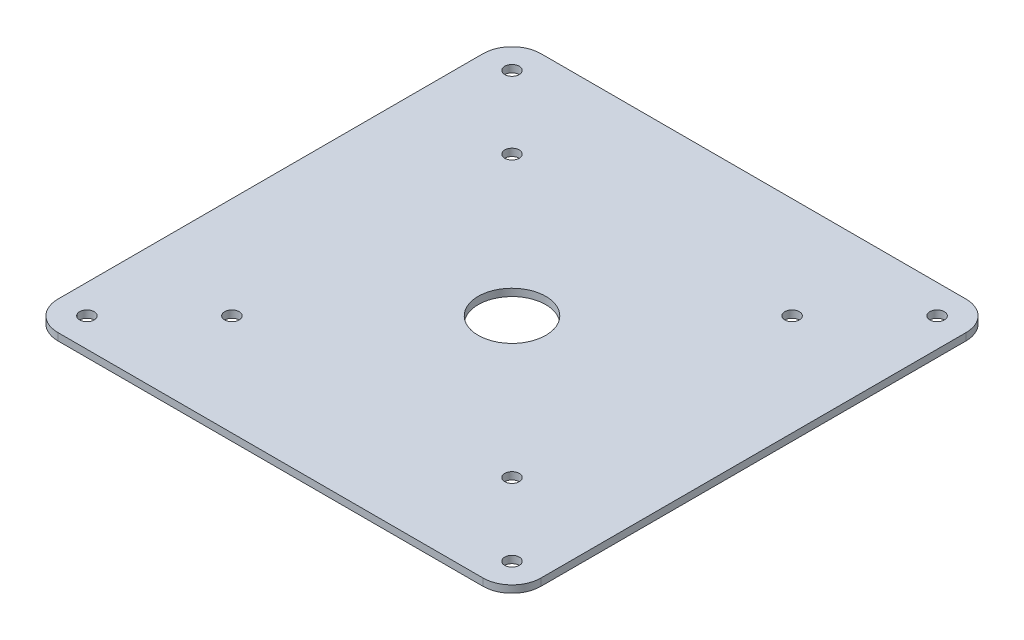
ISO-10303-21;
HEADER;
FILE_DESCRIPTION(('STEP AP214'),'2;1');
FILE_NAME('part.step','',(''),(''),'','','');
FILE_SCHEMA(('AUTOMOTIVE_DESIGN { 1 0 10303 214 1 1 1 1 }'));
ENDSEC;
DATA;
#1=APPLICATION_CONTEXT('core data for automotive mechanical design processes');
#2=APPLICATION_PROTOCOL_DEFINITION('international standard','automotive_design',2000,#1);
#3=PRODUCT_CONTEXT('',#1,'mechanical');
#4=PRODUCT('Part','Part','',(#3));
#5=PRODUCT_RELATED_PRODUCT_CATEGORY('part','',(#4));
#6=PRODUCT_DEFINITION_FORMATION('','',#4);
#7=PRODUCT_DEFINITION_CONTEXT('part definition',#1,'design');
#8=PRODUCT_DEFINITION('design','',#6,#7);
#9=PRODUCT_DEFINITION_SHAPE('','',#8);
#10=(LENGTH_UNIT() NAMED_UNIT(*) SI_UNIT(.MILLI.,.METRE.));
#11=(NAMED_UNIT(*) PLANE_ANGLE_UNIT() SI_UNIT($,.RADIAN.));
#12=(NAMED_UNIT(*) SI_UNIT($,.STERADIAN.) SOLID_ANGLE_UNIT());
#13=UNCERTAINTY_MEASURE_WITH_UNIT(LENGTH_MEASURE(1.E-05),#10,'distance_accuracy_value','');
#14=(GEOMETRIC_REPRESENTATION_CONTEXT(3) GLOBAL_UNCERTAINTY_ASSIGNED_CONTEXT((#13)) GLOBAL_UNIT_ASSIGNED_CONTEXT((#10,
#11,#12)) REPRESENTATION_CONTEXT('',''));
#15=CARTESIAN_POINT('',(0.,0.,0.));
#16=DIRECTION('',(0.,0.,1.));
#17=DIRECTION('',(1.,0.,0.));
#18=AXIS2_PLACEMENT_3D('',#15,#16,#17);
#19=CARTESIAN_POINT('',(-50.,-1.5,50.));
#20=DIRECTION('',(-1.,0.,0.));
#21=DIRECTION('',(0.,0.,1.));
#22=AXIS2_PLACEMENT_3D('',#19,#20,#21);
#23=PLANE('',#22);
#24=DIRECTION('',(0.,0.,1.));
#25=VECTOR('',#24,1.);
#26=CARTESIAN_POINT('',(-50.,0.,50.));
#27=LINE('',#26,#25);
#28=CARTESIAN_POINT('',(-50.,0.,-44.));
#29=VERTEX_POINT('',#28);
#30=CARTESIAN_POINT('',(-50.,0.,44.));
#31=VERTEX_POINT('',#30);
#32=EDGE_CURVE('E168',#29,#31,#27,.T.);
#33=ORIENTED_EDGE('',*,*,#32,.F.);
#34=DIRECTION('',(0.,1.,0.));
#35=VECTOR('',#34,1.);
#36=CARTESIAN_POINT('',(-50.,-1.5,-44.));
#37=LINE('',#36,#35);
#38=CARTESIAN_POINT('',(-50.,-1.5,-44.));
#39=VERTEX_POINT('',#38);
#40=EDGE_CURVE('E148',#29,#39,#37,.F.);
#41=ORIENTED_EDGE('',*,*,#40,.T.);
#42=DIRECTION('',(0.,0.,1.));
#43=VECTOR('',#42,1.);
#44=CARTESIAN_POINT('',(-50.,-1.5,50.));
#45=LINE('',#44,#43);
#46=CARTESIAN_POINT('',(-50.,-1.5,44.));
#47=VERTEX_POINT('',#46);
#48=EDGE_CURVE('E129',#39,#47,#45,.T.);
#49=ORIENTED_EDGE('',*,*,#48,.T.);
#50=DIRECTION('',(0.,1.,0.));
#51=VECTOR('',#50,1.);
#52=CARTESIAN_POINT('',(-50.,-1.5,44.));
#53=LINE('',#52,#51);
#54=EDGE_CURVE('E145',#47,#31,#53,.T.);
#55=ORIENTED_EDGE('',*,*,#54,.T.);
#56=EDGE_LOOP('',(#33,#41,#49,#55));
#57=FACE_BOUND('',#56,.T.);
#58=ADVANCED_FACE('F42',(#57),#23,.T.);
#59=CARTESIAN_POINT('',(50.,-1.5,-50.));
#60=DIRECTION('',(0.,0.,-1.));
#61=DIRECTION('',(-1.,0.,0.));
#62=AXIS2_PLACEMENT_3D('',#59,#60,#61);
#63=PLANE('',#62);
#64=DIRECTION('',(-1.,0.,0.));
#65=VECTOR('',#64,1.);
#66=CARTESIAN_POINT('',(50.,-1.5,-50.));
#67=LINE('',#66,#65);
#68=CARTESIAN_POINT('',(44.,-1.5,-50.));
#69=VERTEX_POINT('',#68);
#70=CARTESIAN_POINT('',(-44.,-1.5,-50.));
#71=VERTEX_POINT('',#70);
#72=EDGE_CURVE('E134',#69,#71,#67,.T.);
#73=ORIENTED_EDGE('',*,*,#72,.T.);
#74=DIRECTION('',(0.,1.,0.));
#75=VECTOR('',#74,1.);
#76=CARTESIAN_POINT('',(-44.,-1.5,-50.));
#77=LINE('',#76,#75);
#78=CARTESIAN_POINT('',(-44.,0.,-50.));
#79=VERTEX_POINT('',#78);
#80=EDGE_CURVE('E128',#71,#79,#77,.T.);
#81=ORIENTED_EDGE('',*,*,#80,.T.);
#82=DIRECTION('',(-1.,0.,0.));
#83=VECTOR('',#82,1.);
#84=CARTESIAN_POINT('',(50.,0.,-50.));
#85=LINE('',#84,#83);
#86=CARTESIAN_POINT('',(44.,0.,-50.));
#87=VERTEX_POINT('',#86);
#88=EDGE_CURVE('E111',#87,#79,#85,.T.);
#89=ORIENTED_EDGE('',*,*,#88,.F.);
#90=DIRECTION('',(0.,1.,0.));
#91=VECTOR('',#90,1.);
#92=CARTESIAN_POINT('',(44.,-1.5,-50.));
#93=LINE('',#92,#91);
#94=EDGE_CURVE('E125',#87,#69,#93,.F.);
#95=ORIENTED_EDGE('',*,*,#94,.T.);
#96=EDGE_LOOP('',(#73,#81,#89,#95));
#97=FACE_BOUND('',#96,.T.);
#98=ADVANCED_FACE('F124',(#97),#63,.T.);
#99=CARTESIAN_POINT('',(50.,-1.5,50.));
#100=DIRECTION('',(1.,0.,0.));
#101=DIRECTION('',(0.,0.,-1.));
#102=AXIS2_PLACEMENT_3D('',#99,#100,#101);
#103=PLANE('',#102);
#104=DIRECTION('',(0.,0.,-1.));
#105=VECTOR('',#104,1.);
#106=CARTESIAN_POINT('',(50.,-1.5,50.));
#107=LINE('',#106,#105);
#108=CARTESIAN_POINT('',(50.,-1.5,44.));
#109=VERTEX_POINT('',#108);
#110=CARTESIAN_POINT('',(50.,-1.5,-44.));
#111=VERTEX_POINT('',#110);
#112=EDGE_CURVE('E138',#109,#111,#107,.T.);
#113=ORIENTED_EDGE('',*,*,#112,.T.);
#114=DIRECTION('',(0.,1.,0.));
#115=VECTOR('',#114,1.);
#116=CARTESIAN_POINT('',(50.,-1.5,-44.));
#117=LINE('',#116,#115);
#118=CARTESIAN_POINT('',(50.,0.,-44.));
#119=VERTEX_POINT('',#118);
#120=EDGE_CURVE('E158',#111,#119,#117,.T.);
#121=ORIENTED_EDGE('',*,*,#120,.T.);
#122=DIRECTION('',(0.,0.,-1.));
#123=VECTOR('',#122,1.);
#124=CARTESIAN_POINT('',(50.,0.,50.));
#125=LINE('',#124,#123);
#126=CARTESIAN_POINT('',(50.,0.,44.));
#127=VERTEX_POINT('',#126);
#128=EDGE_CURVE('E113',#127,#119,#125,.T.);
#129=ORIENTED_EDGE('',*,*,#128,.F.);
#130=DIRECTION('',(0.,1.,0.));
#131=VECTOR('',#130,1.);
#132=CARTESIAN_POINT('',(50.,-1.5,44.));
#133=LINE('',#132,#131);
#134=EDGE_CURVE('E156',#127,#109,#133,.F.);
#135=ORIENTED_EDGE('',*,*,#134,.T.);
#136=EDGE_LOOP('',(#113,#121,#129,#135));
#137=FACE_BOUND('',#136,.T.);
#138=ADVANCED_FACE('F161',(#137),#103,.T.);
#139=CARTESIAN_POINT('',(50.,-1.5,50.));
#140=DIRECTION('',(0.,0.,1.));
#141=DIRECTION('',(1.,0.,0.));
#142=AXIS2_PLACEMENT_3D('',#139,#140,#141);
#143=PLANE('',#142);
#144=DIRECTION('',(1.,0.,0.));
#145=VECTOR('',#144,1.);
#146=CARTESIAN_POINT('',(50.,-1.5,50.));
#147=LINE('',#146,#145);
#148=CARTESIAN_POINT('',(-44.,-1.5,50.));
#149=VERTEX_POINT('',#148);
#150=CARTESIAN_POINT('',(44.,-1.5,50.));
#151=VERTEX_POINT('',#150);
#152=EDGE_CURVE('E163',#149,#151,#147,.T.);
#153=ORIENTED_EDGE('',*,*,#152,.T.);
#154=DIRECTION('',(0.,1.,0.));
#155=VECTOR('',#154,1.);
#156=CARTESIAN_POINT('',(44.,-1.5,50.));
#157=LINE('',#156,#155);
#158=CARTESIAN_POINT('',(44.,0.,50.));
#159=VERTEX_POINT('',#158);
#160=EDGE_CURVE('E11',#151,#159,#157,.T.);
#161=ORIENTED_EDGE('',*,*,#160,.T.);
#162=DIRECTION('',(1.,0.,0.));
#163=VECTOR('',#162,1.);
#164=CARTESIAN_POINT('',(50.,0.,50.));
#165=LINE('',#164,#163);
#166=CARTESIAN_POINT('',(-44.,0.,50.));
#167=VERTEX_POINT('',#166);
#168=EDGE_CURVE('E171',#167,#159,#165,.T.);
#169=ORIENTED_EDGE('',*,*,#168,.F.);
#170=DIRECTION('',(0.,1.,0.));
#171=VECTOR('',#170,1.);
#172=CARTESIAN_POINT('',(-44.,-1.5,50.));
#173=LINE('',#172,#171);
#174=EDGE_CURVE('E50',#167,#149,#173,.F.);
#175=ORIENTED_EDGE('',*,*,#174,.T.);
#176=EDGE_LOOP('',(#153,#161,#169,#175));
#177=FACE_BOUND('',#176,.T.);
#178=ADVANCED_FACE('F174',(#177),#143,.T.);
#179=CARTESIAN_POINT('',(0.,-1.5,0.));
#180=DIRECTION('',(0.,1.,0.));
#181=DIRECTION('',(0.,0.,1.));
#182=AXIS2_PLACEMENT_3D('',#179,#180,#181);
#183=PLANE('',#182);
#184=CARTESIAN_POINT('',(0.,-1.5,0.));
#185=DIRECTION('',(0.,1.,0.));
#186=DIRECTION('',(0.,0.,1.));
#187=AXIS2_PLACEMENT_3D('',#184,#185,#186);
#188=CIRCLE('',#187,7.);
#189=CARTESIAN_POINT('',(0.,-1.5,7.));
#190=VERTEX_POINT('',#189);
#191=EDGE_CURVE('E221',#190,#190,#188,.T.);
#192=ORIENTED_EDGE('',*,*,#191,.T.);
#193=EDGE_LOOP('',(#192));
#194=FACE_BOUND('',#193,.T.);
#195=CARTESIAN_POINT('',(-44.,-1.5,44.));
#196=DIRECTION('',(0.,1.,0.));
#197=DIRECTION('',(0.,0.,-1.));
#198=AXIS2_PLACEMENT_3D('',#195,#196,#197);
#199=CIRCLE('',#198,1.5);
#200=CARTESIAN_POINT('',(-44.,-1.5,42.5));
#201=VERTEX_POINT('',#200);
#202=EDGE_CURVE('E217',#201,#201,#199,.T.);
#203=ORIENTED_EDGE('',*,*,#202,.T.);
#204=EDGE_LOOP('',(#203));
#205=FACE_BOUND('',#204,.T.);
#206=CARTESIAN_POINT('',(44.,-1.5,44.));
#207=DIRECTION('',(0.,1.,0.));
#208=DIRECTION('',(0.,0.,-1.));
#209=AXIS2_PLACEMENT_3D('',#206,#207,#208);
#210=CIRCLE('',#209,1.5);
#211=CARTESIAN_POINT('',(44.,-1.5,42.5));
#212=VERTEX_POINT('',#211);
#213=EDGE_CURVE('E224',#212,#212,#210,.T.);
#214=ORIENTED_EDGE('',*,*,#213,.T.);
#215=EDGE_LOOP('',(#214));
#216=FACE_BOUND('',#215,.T.);
#217=CARTESIAN_POINT('',(44.,-1.5,-44.));
#218=DIRECTION('',(0.,1.,0.));
#219=DIRECTION('',(0.,0.,1.));
#220=AXIS2_PLACEMENT_3D('',#217,#218,#219);
#221=CIRCLE('',#220,1.5);
#222=CARTESIAN_POINT('',(44.,-1.5,-42.5));
#223=VERTEX_POINT('',#222);
#224=EDGE_CURVE('E230',#223,#223,#221,.T.);
#225=ORIENTED_EDGE('',*,*,#224,.T.);
#226=EDGE_LOOP('',(#225));
#227=FACE_BOUND('',#226,.T.);
#228=CARTESIAN_POINT('',(-44.,-1.5,-44.));
#229=DIRECTION('',(0.,1.,0.));
#230=DIRECTION('',(0.,0.,1.));
#231=AXIS2_PLACEMENT_3D('',#228,#229,#230);
#232=CIRCLE('',#231,1.5);
#233=CARTESIAN_POINT('',(-44.,-1.5,-42.5));
#234=VERTEX_POINT('',#233);
#235=EDGE_CURVE('E208',#234,#234,#232,.T.);
#236=ORIENTED_EDGE('',*,*,#235,.T.);
#237=EDGE_LOOP('',(#236));
#238=FACE_BOUND('',#237,.T.);
#239=CARTESIAN_POINT('',(-28.9913780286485,-1.5,28.9913780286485));
#240=DIRECTION('',(0.,1.,0.));
#241=DIRECTION('',(0.,0.,1.));
#242=AXIS2_PLACEMENT_3D('',#239,#240,#241);
#243=CIRCLE('',#242,1.5);
#244=CARTESIAN_POINT('',(-28.9913780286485,-1.5,30.4913780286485));
#245=VERTEX_POINT('',#244);
#246=EDGE_CURVE('E202',#245,#245,#243,.T.);
#247=ORIENTED_EDGE('',*,*,#246,.T.);
#248=EDGE_LOOP('',(#247));
#249=FACE_BOUND('',#248,.T.);
#250=CARTESIAN_POINT('',(-28.9913780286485,-1.5,-28.9913780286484));
#251=DIRECTION('',(0.,1.,0.));
#252=DIRECTION('',(0.,0.,1.));
#253=AXIS2_PLACEMENT_3D('',#250,#251,#252);
#254=CIRCLE('',#253,1.5);
#255=CARTESIAN_POINT('',(-28.9913780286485,-1.5,-27.4913780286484));
#256=VERTEX_POINT('',#255);
#257=EDGE_CURVE('E196',#256,#256,#254,.T.);
#258=ORIENTED_EDGE('',*,*,#257,.T.);
#259=EDGE_LOOP('',(#258));
#260=FACE_BOUND('',#259,.T.);
#261=CARTESIAN_POINT('',(28.9913780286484,-1.5,28.9913780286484));
#262=DIRECTION('',(0.,1.,0.));
#263=DIRECTION('',(0.,0.,1.));
#264=AXIS2_PLACEMENT_3D('',#261,#262,#263);
#265=CIRCLE('',#264,1.5);
#266=CARTESIAN_POINT('',(28.9913780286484,-1.5,30.4913780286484));
#267=VERTEX_POINT('',#266);
#268=EDGE_CURVE('E190',#267,#267,#265,.T.);
#269=ORIENTED_EDGE('',*,*,#268,.T.);
#270=EDGE_LOOP('',(#269));
#271=FACE_BOUND('',#270,.T.);
#272=CARTESIAN_POINT('',(28.9913780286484,-1.5,-28.9913780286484));
#273=DIRECTION('',(0.,1.,0.));
#274=DIRECTION('',(0.,0.,1.));
#275=AXIS2_PLACEMENT_3D('',#272,#273,#274);
#276=CIRCLE('',#275,1.5);
#277=CARTESIAN_POINT('',(28.9913780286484,-1.5,-27.4913780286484));
#278=VERTEX_POINT('',#277);
#279=EDGE_CURVE('E172',#278,#278,#276,.T.);
#280=ORIENTED_EDGE('',*,*,#279,.T.);
#281=EDGE_LOOP('',(#280));
#282=FACE_BOUND('',#281,.T.);
#283=ORIENTED_EDGE('',*,*,#48,.F.);
#284=CARTESIAN_POINT('',(-44.,-1.5,-44.));
#285=DIRECTION('',(0.,1.,0.));
#286=DIRECTION('',(0.,0.,1.));
#287=AXIS2_PLACEMENT_3D('',#284,#285,#286);
#288=CIRCLE('',#287,6.);
#289=EDGE_CURVE('E154',#39,#71,#288,.F.);
#290=ORIENTED_EDGE('',*,*,#289,.T.);
#291=ORIENTED_EDGE('',*,*,#72,.F.);
#292=CARTESIAN_POINT('',(44.,-1.5,-44.));
#293=DIRECTION('',(0.,1.,0.));
#294=DIRECTION('',(0.,0.,1.));
#295=AXIS2_PLACEMENT_3D('',#292,#293,#294);
#296=CIRCLE('',#295,6.);
#297=EDGE_CURVE('E133',#69,#111,#296,.F.);
#298=ORIENTED_EDGE('',*,*,#297,.T.);
#299=ORIENTED_EDGE('',*,*,#112,.F.);
#300=CARTESIAN_POINT('',(44.,-1.5,44.));
#301=DIRECTION('',(0.,1.,0.));
#302=DIRECTION('',(0.,0.,1.));
#303=AXIS2_PLACEMENT_3D('',#300,#301,#302);
#304=CIRCLE('',#303,6.);
#305=EDGE_CURVE('E57',#109,#151,#304,.F.);
#306=ORIENTED_EDGE('',*,*,#305,.T.);
#307=ORIENTED_EDGE('',*,*,#152,.F.);
#308=CARTESIAN_POINT('',(-44.,-1.5,44.));
#309=DIRECTION('',(0.,1.,0.));
#310=DIRECTION('',(0.,0.,1.));
#311=AXIS2_PLACEMENT_3D('',#308,#309,#310);
#312=CIRCLE('',#311,6.);
#313=EDGE_CURVE('E150',#149,#47,#312,.F.);
#314=ORIENTED_EDGE('',*,*,#313,.T.);
#315=EDGE_LOOP('',(#283,#290,#291,#298,#299,#306,#307,#314));
#316=FACE_BOUND('',#315,.T.);
#317=ADVANCED_FACE('F181',(#194,#205,#216,#227,#238,#249,#260,#271,#282,#316),#183,.F.);
#318=CARTESIAN_POINT('',(0.,0.,0.));
#319=DIRECTION('',(0.,1.,0.));
#320=DIRECTION('',(0.,0.,1.));
#321=AXIS2_PLACEMENT_3D('',#318,#319,#320);
#322=PLANE('',#321);
#323=CARTESIAN_POINT('',(0.,0.,0.));
#324=DIRECTION('',(0.,1.,0.));
#325=DIRECTION('',(0.,0.,1.));
#326=AXIS2_PLACEMENT_3D('',#323,#324,#325);
#327=CIRCLE('',#326,7.);
#328=CARTESIAN_POINT('',(0.,0.,7.));
#329=VERTEX_POINT('',#328);
#330=EDGE_CURVE('E235',#329,#329,#327,.T.);
#331=ORIENTED_EDGE('',*,*,#330,.F.);
#332=EDGE_LOOP('',(#331));
#333=FACE_BOUND('',#332,.T.);
#334=CARTESIAN_POINT('',(-44.,0.,44.));
#335=DIRECTION('',(0.,1.,0.));
#336=DIRECTION('',(0.,0.,-1.));
#337=AXIS2_PLACEMENT_3D('',#334,#335,#336);
#338=CIRCLE('',#337,1.5);
#339=CARTESIAN_POINT('',(-44.,0.,42.5));
#340=VERTEX_POINT('',#339);
#341=EDGE_CURVE('E220',#340,#340,#338,.T.);
#342=ORIENTED_EDGE('',*,*,#341,.F.);
#343=EDGE_LOOP('',(#342));
#344=FACE_BOUND('',#343,.T.);
#345=CARTESIAN_POINT('',(44.,0.,44.));
#346=DIRECTION('',(0.,1.,0.));
#347=DIRECTION('',(0.,0.,-1.));
#348=AXIS2_PLACEMENT_3D('',#345,#346,#347);
#349=CIRCLE('',#348,1.5);
#350=CARTESIAN_POINT('',(44.,0.,42.5));
#351=VERTEX_POINT('',#350);
#352=EDGE_CURVE('E227',#351,#351,#349,.T.);
#353=ORIENTED_EDGE('',*,*,#352,.F.);
#354=EDGE_LOOP('',(#353));
#355=FACE_BOUND('',#354,.T.);
#356=CARTESIAN_POINT('',(44.,0.,-44.));
#357=DIRECTION('',(0.,1.,0.));
#358=DIRECTION('',(0.,0.,1.));
#359=AXIS2_PLACEMENT_3D('',#356,#357,#358);
#360=CIRCLE('',#359,1.5);
#361=CARTESIAN_POINT('',(44.,0.,-42.5));
#362=VERTEX_POINT('',#361);
#363=EDGE_CURVE('E214',#362,#362,#360,.T.);
#364=ORIENTED_EDGE('',*,*,#363,.F.);
#365=EDGE_LOOP('',(#364));
#366=FACE_BOUND('',#365,.T.);
#367=CARTESIAN_POINT('',(-44.,0.,-44.));
#368=DIRECTION('',(0.,1.,0.));
#369=DIRECTION('',(0.,0.,1.));
#370=AXIS2_PLACEMENT_3D('',#367,#368,#369);
#371=CIRCLE('',#370,1.5);
#372=CARTESIAN_POINT('',(-44.,0.,-42.5));
#373=VERTEX_POINT('',#372);
#374=EDGE_CURVE('E211',#373,#373,#371,.T.);
#375=ORIENTED_EDGE('',*,*,#374,.F.);
#376=EDGE_LOOP('',(#375));
#377=FACE_BOUND('',#376,.T.);
#378=CARTESIAN_POINT('',(-28.9913780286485,0.,28.9913780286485));
#379=DIRECTION('',(0.,1.,0.));
#380=DIRECTION('',(0.,0.,1.));
#381=AXIS2_PLACEMENT_3D('',#378,#379,#380);
#382=CIRCLE('',#381,1.5);
#383=CARTESIAN_POINT('',(-28.9913780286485,0.,30.4913780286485));
#384=VERTEX_POINT('',#383);
#385=EDGE_CURVE('E205',#384,#384,#382,.T.);
#386=ORIENTED_EDGE('',*,*,#385,.F.);
#387=EDGE_LOOP('',(#386));
#388=FACE_BOUND('',#387,.T.);
#389=CARTESIAN_POINT('',(-28.9913780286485,0.,-28.9913780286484));
#390=DIRECTION('',(0.,1.,0.));
#391=DIRECTION('',(0.,0.,1.));
#392=AXIS2_PLACEMENT_3D('',#389,#390,#391);
#393=CIRCLE('',#392,1.5);
#394=CARTESIAN_POINT('',(-28.9913780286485,0.,-27.4913780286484));
#395=VERTEX_POINT('',#394);
#396=EDGE_CURVE('E199',#395,#395,#393,.T.);
#397=ORIENTED_EDGE('',*,*,#396,.F.);
#398=EDGE_LOOP('',(#397));
#399=FACE_BOUND('',#398,.T.);
#400=CARTESIAN_POINT('',(28.9913780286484,0.,28.9913780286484));
#401=DIRECTION('',(0.,1.,0.));
#402=DIRECTION('',(0.,0.,1.));
#403=AXIS2_PLACEMENT_3D('',#400,#401,#402);
#404=CIRCLE('',#403,1.5);
#405=CARTESIAN_POINT('',(28.9913780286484,0.,30.4913780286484));
#406=VERTEX_POINT('',#405);
#407=EDGE_CURVE('E193',#406,#406,#404,.T.);
#408=ORIENTED_EDGE('',*,*,#407,.F.);
#409=EDGE_LOOP('',(#408));
#410=FACE_BOUND('',#409,.T.);
#411=CARTESIAN_POINT('',(28.9913780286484,0.,-28.9913780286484));
#412=DIRECTION('',(0.,1.,0.));
#413=DIRECTION('',(0.,0.,1.));
#414=AXIS2_PLACEMENT_3D('',#411,#412,#413);
#415=CIRCLE('',#414,1.5);
#416=CARTESIAN_POINT('',(28.9913780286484,0.,-27.4913780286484));
#417=VERTEX_POINT('',#416);
#418=EDGE_CURVE('E187',#417,#417,#415,.T.);
#419=ORIENTED_EDGE('',*,*,#418,.F.);
#420=EDGE_LOOP('',(#419));
#421=FACE_BOUND('',#420,.T.);
#422=ORIENTED_EDGE('',*,*,#88,.T.);
#423=CARTESIAN_POINT('',(-44.,0.,-44.));
#424=DIRECTION('',(0.,1.,0.));
#425=DIRECTION('',(0.,0.,1.));
#426=AXIS2_PLACEMENT_3D('',#423,#424,#425);
#427=CIRCLE('',#426,6.);
#428=EDGE_CURVE('E118',#79,#29,#427,.T.);
#429=ORIENTED_EDGE('',*,*,#428,.T.);
#430=ORIENTED_EDGE('',*,*,#32,.T.);
#431=CARTESIAN_POINT('',(-44.,0.,44.));
#432=DIRECTION('',(0.,1.,0.));
#433=DIRECTION('',(0.,0.,1.));
#434=AXIS2_PLACEMENT_3D('',#431,#432,#433);
#435=CIRCLE('',#434,6.);
#436=EDGE_CURVE('E136',#31,#167,#435,.T.);
#437=ORIENTED_EDGE('',*,*,#436,.T.);
#438=ORIENTED_EDGE('',*,*,#168,.T.);
#439=CARTESIAN_POINT('',(44.,0.,44.));
#440=DIRECTION('',(0.,1.,0.));
#441=DIRECTION('',(0.,0.,1.));
#442=AXIS2_PLACEMENT_3D('',#439,#440,#441);
#443=CIRCLE('',#442,6.);
#444=EDGE_CURVE('E119',#159,#127,#443,.T.);
#445=ORIENTED_EDGE('',*,*,#444,.T.);
#446=ORIENTED_EDGE('',*,*,#128,.T.);
#447=CARTESIAN_POINT('',(44.,0.,-44.));
#448=DIRECTION('',(0.,1.,0.));
#449=DIRECTION('',(0.,0.,1.));
#450=AXIS2_PLACEMENT_3D('',#447,#448,#449);
#451=CIRCLE('',#450,6.);
#452=EDGE_CURVE('E108',#119,#87,#451,.T.);
#453=ORIENTED_EDGE('',*,*,#452,.T.);
#454=EDGE_LOOP('',(#422,#429,#430,#437,#438,#445,#446,#453));
#455=FACE_BOUND('',#454,.T.);
#456=ADVANCED_FACE('F110',(#333,#344,#355,#366,#377,#388,#399,#410,#421,#455),#322,.T.);
#457=CARTESIAN_POINT('',(28.9913780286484,-1.5,-28.9913780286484));
#458=DIRECTION('',(0.,1.,0.));
#459=DIRECTION('',(0.,0.,1.));
#460=AXIS2_PLACEMENT_3D('',#457,#458,#459);
#461=CYLINDRICAL_SURFACE('',#460,1.5);
#462=ORIENTED_EDGE('',*,*,#279,.F.);
#463=EDGE_LOOP('',(#462));
#464=FACE_BOUND('',#463,.T.);
#465=ORIENTED_EDGE('',*,*,#418,.T.);
#466=EDGE_LOOP('',(#465));
#467=FACE_BOUND('',#466,.T.);
#468=ADVANCED_FACE('F252',(#464,#467),#461,.F.);
#469=CARTESIAN_POINT('',(28.9913780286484,-1.5,28.9913780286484));
#470=DIRECTION('',(0.,1.,0.));
#471=DIRECTION('',(0.,0.,1.));
#472=AXIS2_PLACEMENT_3D('',#469,#470,#471);
#473=CYLINDRICAL_SURFACE('',#472,1.5);
#474=ORIENTED_EDGE('',*,*,#268,.F.);
#475=EDGE_LOOP('',(#474));
#476=FACE_BOUND('',#475,.T.);
#477=ORIENTED_EDGE('',*,*,#407,.T.);
#478=EDGE_LOOP('',(#477));
#479=FACE_BOUND('',#478,.T.);
#480=ADVANCED_FACE('F271',(#476,#479),#473,.F.);
#481=CARTESIAN_POINT('',(-28.9913780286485,-1.5,-28.9913780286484));
#482=DIRECTION('',(0.,1.,0.));
#483=DIRECTION('',(0.,0.,1.));
#484=AXIS2_PLACEMENT_3D('',#481,#482,#483);
#485=CYLINDRICAL_SURFACE('',#484,1.5);
#486=ORIENTED_EDGE('',*,*,#257,.F.);
#487=EDGE_LOOP('',(#486));
#488=FACE_BOUND('',#487,.T.);
#489=ORIENTED_EDGE('',*,*,#396,.T.);
#490=EDGE_LOOP('',(#489));
#491=FACE_BOUND('',#490,.T.);
#492=ADVANCED_FACE('F278',(#488,#491),#485,.F.);
#493=CARTESIAN_POINT('',(-28.9913780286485,-1.5,28.9913780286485));
#494=DIRECTION('',(0.,1.,0.));
#495=DIRECTION('',(0.,0.,1.));
#496=AXIS2_PLACEMENT_3D('',#493,#494,#495);
#497=CYLINDRICAL_SURFACE('',#496,1.5);
#498=ORIENTED_EDGE('',*,*,#246,.F.);
#499=EDGE_LOOP('',(#498));
#500=FACE_BOUND('',#499,.T.);
#501=ORIENTED_EDGE('',*,*,#385,.T.);
#502=EDGE_LOOP('',(#501));
#503=FACE_BOUND('',#502,.T.);
#504=ADVANCED_FACE('F296',(#500,#503),#497,.F.);
#505=CARTESIAN_POINT('',(-44.,-1.5,-44.));
#506=DIRECTION('',(0.,1.,0.));
#507=DIRECTION('',(0.,0.,1.));
#508=AXIS2_PLACEMENT_3D('',#505,#506,#507);
#509=CYLINDRICAL_SURFACE('',#508,6.);
#510=ORIENTED_EDGE('',*,*,#289,.F.);
#511=ORIENTED_EDGE('',*,*,#40,.F.);
#512=ORIENTED_EDGE('',*,*,#428,.F.);
#513=ORIENTED_EDGE('',*,*,#80,.F.);
#514=EDGE_LOOP('',(#510,#511,#512,#513));
#515=FACE_BOUND('',#514,.T.);
#516=ADVANCED_FACE('F293',(#515),#509,.T.);
#517=CARTESIAN_POINT('',(44.,-1.5,-44.));
#518=DIRECTION('',(0.,1.,0.));
#519=DIRECTION('',(0.,0.,1.));
#520=AXIS2_PLACEMENT_3D('',#517,#518,#519);
#521=CYLINDRICAL_SURFACE('',#520,6.);
#522=ORIENTED_EDGE('',*,*,#297,.F.);
#523=ORIENTED_EDGE('',*,*,#94,.F.);
#524=ORIENTED_EDGE('',*,*,#452,.F.);
#525=ORIENTED_EDGE('',*,*,#120,.F.);
#526=EDGE_LOOP('',(#522,#523,#524,#525));
#527=FACE_BOUND('',#526,.T.);
#528=ADVANCED_FACE('F132',(#527),#521,.T.);
#529=CARTESIAN_POINT('',(44.,-1.5,44.));
#530=DIRECTION('',(0.,1.,0.));
#531=DIRECTION('',(0.,0.,1.));
#532=AXIS2_PLACEMENT_3D('',#529,#530,#531);
#533=CYLINDRICAL_SURFACE('',#532,6.);
#534=ORIENTED_EDGE('',*,*,#305,.F.);
#535=ORIENTED_EDGE('',*,*,#134,.F.);
#536=ORIENTED_EDGE('',*,*,#444,.F.);
#537=ORIENTED_EDGE('',*,*,#160,.F.);
#538=EDGE_LOOP('',(#534,#535,#536,#537));
#539=FACE_BOUND('',#538,.T.);
#540=ADVANCED_FACE('F299',(#539),#533,.T.);
#541=CARTESIAN_POINT('',(-44.,-1.5,44.));
#542=DIRECTION('',(0.,1.,0.));
#543=DIRECTION('',(0.,0.,1.));
#544=AXIS2_PLACEMENT_3D('',#541,#542,#543);
#545=CYLINDRICAL_SURFACE('',#544,6.);
#546=ORIENTED_EDGE('',*,*,#313,.F.);
#547=ORIENTED_EDGE('',*,*,#174,.F.);
#548=ORIENTED_EDGE('',*,*,#436,.F.);
#549=ORIENTED_EDGE('',*,*,#54,.F.);
#550=EDGE_LOOP('',(#546,#547,#548,#549));
#551=FACE_BOUND('',#550,.T.);
#552=ADVANCED_FACE('F44',(#551),#545,.T.);
#553=CARTESIAN_POINT('',(-44.,-1.5,-44.));
#554=DIRECTION('',(0.,1.,0.));
#555=DIRECTION('',(0.,0.,1.));
#556=AXIS2_PLACEMENT_3D('',#553,#554,#555);
#557=CYLINDRICAL_SURFACE('',#556,1.5);
#558=ORIENTED_EDGE('',*,*,#235,.F.);
#559=EDGE_LOOP('',(#558));
#560=FACE_BOUND('',#559,.T.);
#561=ORIENTED_EDGE('',*,*,#374,.T.);
#562=EDGE_LOOP('',(#561));
#563=FACE_BOUND('',#562,.T.);
#564=ADVANCED_FACE('F305',(#560,#563),#557,.F.);
#565=CARTESIAN_POINT('',(44.,-1.5,-44.));
#566=DIRECTION('',(0.,1.,0.));
#567=DIRECTION('',(0.,0.,1.));
#568=AXIS2_PLACEMENT_3D('',#565,#566,#567);
#569=CYLINDRICAL_SURFACE('',#568,1.5);
#570=ORIENTED_EDGE('',*,*,#224,.F.);
#571=EDGE_LOOP('',(#570));
#572=FACE_BOUND('',#571,.T.);
#573=ORIENTED_EDGE('',*,*,#363,.T.);
#574=EDGE_LOOP('',(#573));
#575=FACE_BOUND('',#574,.T.);
#576=ADVANCED_FACE('F309',(#572,#575),#569,.F.);
#577=CARTESIAN_POINT('',(44.,-1.5,44.));
#578=DIRECTION('',(0.,1.,0.));
#579=DIRECTION('',(0.,0.,1.));
#580=AXIS2_PLACEMENT_3D('',#577,#578,#579);
#581=CYLINDRICAL_SURFACE('',#580,1.5);
#582=ORIENTED_EDGE('',*,*,#213,.F.);
#583=EDGE_LOOP('',(#582));
#584=FACE_BOUND('',#583,.T.);
#585=ORIENTED_EDGE('',*,*,#352,.T.);
#586=EDGE_LOOP('',(#585));
#587=FACE_BOUND('',#586,.T.);
#588=ADVANCED_FACE('F315',(#584,#587),#581,.F.);
#589=CARTESIAN_POINT('',(-44.,-1.5,44.));
#590=DIRECTION('',(0.,1.,0.));
#591=DIRECTION('',(0.,0.,1.));
#592=AXIS2_PLACEMENT_3D('',#589,#590,#591);
#593=CYLINDRICAL_SURFACE('',#592,1.5);
#594=ORIENTED_EDGE('',*,*,#202,.F.);
#595=EDGE_LOOP('',(#594));
#596=FACE_BOUND('',#595,.T.);
#597=ORIENTED_EDGE('',*,*,#341,.T.);
#598=EDGE_LOOP('',(#597));
#599=FACE_BOUND('',#598,.T.);
#600=ADVANCED_FACE('F246',(#596,#599),#593,.F.);
#601=CARTESIAN_POINT('',(0.,-1.5,0.));
#602=DIRECTION('',(0.,1.,0.));
#603=DIRECTION('',(0.,0.,1.));
#604=AXIS2_PLACEMENT_3D('',#601,#602,#603);
#605=CYLINDRICAL_SURFACE('',#604,7.);
#606=ORIENTED_EDGE('',*,*,#191,.F.);
#607=EDGE_LOOP('',(#606));
#608=FACE_BOUND('',#607,.T.);
#609=ORIENTED_EDGE('',*,*,#330,.T.);
#610=EDGE_LOOP('',(#609));
#611=FACE_BOUND('',#610,.T.);
#612=ADVANCED_FACE('F243',(#608,#611),#605,.F.);
#613=CLOSED_SHELL('',(#58,#98,#138,#178,#317,#456,#468,#480,#492,#504,#516,#528,#540,#552,#564,
#576,#588,#600,#612));
#614=MANIFOLD_SOLID_BREP('B2',#613);
#615=ADVANCED_BREP_SHAPE_REPRESENTATION('',(#18,#614),#14);
#616=SHAPE_DEFINITION_REPRESENTATION(#9,#615);
ENDSEC;
END-ISO-10303-21;
